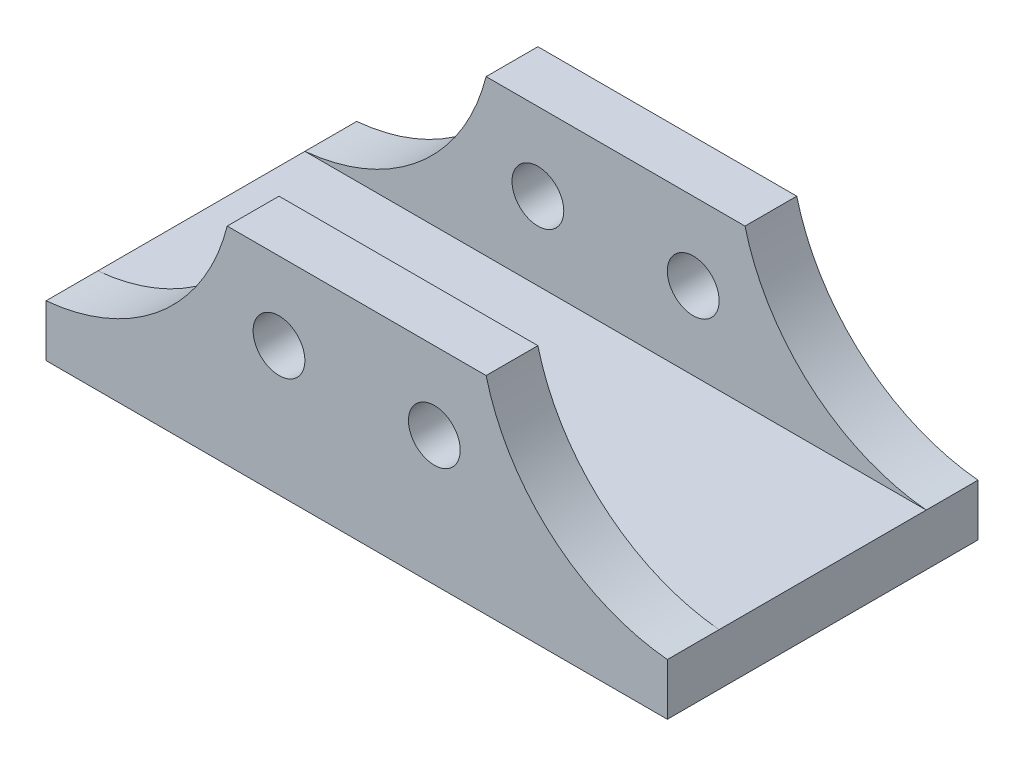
from build123d import *

# Parameters (mm, degrees)
SKETCH1_R      = 6.35
EXTRUDE1_DEPTH = 12.7
SKETCH2_W      = 152.4
SKETCH2_H      = 12.7
EXTRUDE2_DEPTH = 25.4


with BuildPart() as part:
    # Sketch1 → Extrude1 (new body)
    with BuildSketch(Plane.XY):
        with BuildLine():
            Line((-31.75, 38.1), (31.75, 38.1))
            ThreePointArc((31.75, 38.1), (47.934687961, 12.002969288), (76.2, 0))
            Line((76.2, 0), (76.2, -12.7))
            Line((76.2, -12.7), (-76.2, -12.7))
            Line((-76.2, -12.7), (-76.2, 0))
            ThreePointArc((-76.2, 0), (-47.934687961, 12.002969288), (-31.75, 38.1))
        make_face()
        with Locations((-19.05, 19.05)):
            Circle(SKETCH1_R, mode=Mode.SUBTRACT)
        with Locations((19.05, 19.05)):
            Circle(SKETCH1_R, mode=Mode.SUBTRACT)
    extrude1 = extrude(amount=EXTRUDE1_DEPTH)

    # Sketch2 → Extrude2 (add)
    with BuildSketch(Plane.XY.offset(12.7)):
        with Locations((0, -6.35)):
            Rectangle(SKETCH2_W, SKETCH2_H)
    extrude2 = extrude(amount=EXTRUDE2_DEPTH)

    # Mirror1: Extrude1, Extrude2 across plane
    add(extrude1.mirror(Plane(origin=(-76.2, -12.7, 38.1), x_dir=(1, 0, 0), z_dir=(0, 0, 1))))
    add(extrude2.mirror(Plane(origin=(-76.2, -12.7, 38.1), x_dir=(1, 0, 0), z_dir=(0, 0, 1))))


solid = part.part
